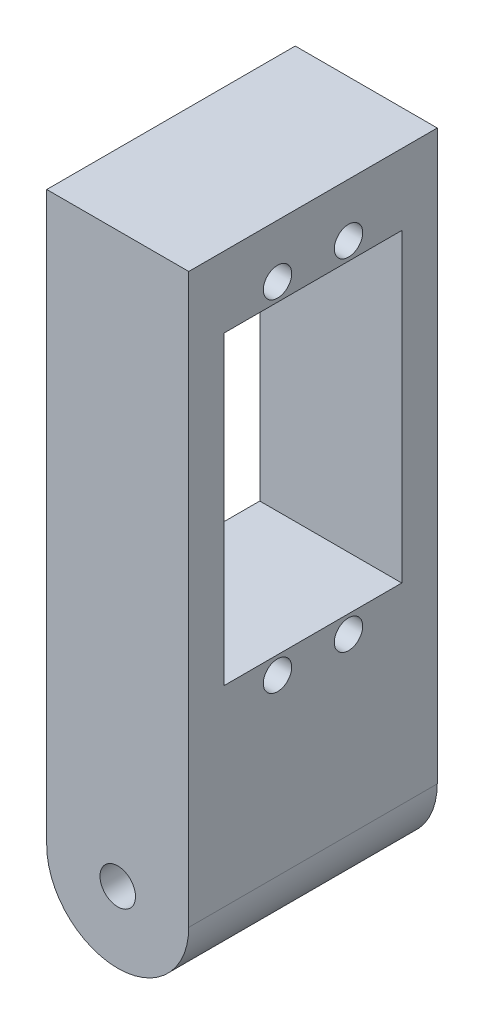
ISO-10303-21;
HEADER;
FILE_DESCRIPTION(('STEP AP214'),'2;1');
FILE_NAME('part.step','',(''),(''),'','','');
FILE_SCHEMA(('AUTOMOTIVE_DESIGN { 1 0 10303 214 1 1 1 1 }'));
ENDSEC;
DATA;
#1=APPLICATION_CONTEXT('core data for automotive mechanical design processes');
#2=APPLICATION_PROTOCOL_DEFINITION('international standard','automotive_design',2000,#1);
#3=PRODUCT_CONTEXT('',#1,'mechanical');
#4=PRODUCT('Part','Part','',(#3));
#5=PRODUCT_RELATED_PRODUCT_CATEGORY('part','',(#4));
#6=PRODUCT_DEFINITION_FORMATION('','',#4);
#7=PRODUCT_DEFINITION_CONTEXT('part definition',#1,'design');
#8=PRODUCT_DEFINITION('design','',#6,#7);
#9=PRODUCT_DEFINITION_SHAPE('','',#8);
#10=(LENGTH_UNIT() NAMED_UNIT(*) SI_UNIT(.MILLI.,.METRE.));
#11=(NAMED_UNIT(*) PLANE_ANGLE_UNIT() SI_UNIT($,.RADIAN.));
#12=(NAMED_UNIT(*) SI_UNIT($,.STERADIAN.) SOLID_ANGLE_UNIT());
#13=UNCERTAINTY_MEASURE_WITH_UNIT(LENGTH_MEASURE(1.E-05),#10,'distance_accuracy_value','');
#14=(GEOMETRIC_REPRESENTATION_CONTEXT(3) GLOBAL_UNCERTAINTY_ASSIGNED_CONTEXT((#13)) GLOBAL_UNIT_ASSIGNED_CONTEXT((#10,
#11,#12)) REPRESENTATION_CONTEXT('',''));
#15=CARTESIAN_POINT('',(0.,0.,0.));
#16=DIRECTION('',(0.,0.,1.));
#17=DIRECTION('',(1.,0.,0.));
#18=AXIS2_PLACEMENT_3D('',#15,#16,#17);
#19=CARTESIAN_POINT('',(10.,-80.,35.));
#20=DIRECTION('',(0.,0.,1.));
#21=DIRECTION('',(1.,0.,0.));
#22=AXIS2_PLACEMENT_3D('',#19,#20,#21);
#23=PLANE('',#22);
#24=DIRECTION('',(0.,-1.,0.));
#25=VECTOR('',#24,1.);
#26=CARTESIAN_POINT('',(0.,-80.,35.));
#27=LINE('',#26,#25);
#28=CARTESIAN_POINT('',(0.,0.,35.));
#29=VERTEX_POINT('',#28);
#30=CARTESIAN_POINT('',(0.,-80.,35.));
#31=VERTEX_POINT('',#30);
#32=EDGE_CURVE('E143',#29,#31,#27,.T.);
#33=ORIENTED_EDGE('',*,*,#32,.T.);
#34=CARTESIAN_POINT('',(10.,-80.,35.));
#35=DIRECTION('',(0.,0.,1.));
#36=DIRECTION('',(1.,0.,0.));
#37=AXIS2_PLACEMENT_3D('',#34,#35,#36);
#38=CIRCLE('',#37,10.);
#39=CARTESIAN_POINT('',(20.,-80.,35.));
#40=VERTEX_POINT('',#39);
#41=EDGE_CURVE('E145',#31,#40,#38,.T.);
#42=ORIENTED_EDGE('',*,*,#41,.T.);
#43=DIRECTION('',(0.,1.,0.));
#44=VECTOR('',#43,1.);
#45=CARTESIAN_POINT('',(20.,0.,35.));
#46=LINE('',#45,#44);
#47=CARTESIAN_POINT('',(20.,0.,35.));
#48=VERTEX_POINT('',#47);
#49=EDGE_CURVE('E150',#40,#48,#46,.T.);
#50=ORIENTED_EDGE('',*,*,#49,.T.);
#51=DIRECTION('',(-1.,0.,0.));
#52=VECTOR('',#51,1.);
#53=CARTESIAN_POINT('',(0.,0.,35.));
#54=LINE('',#53,#52);
#55=EDGE_CURVE('E149',#48,#29,#54,.T.);
#56=ORIENTED_EDGE('',*,*,#55,.T.);
#57=EDGE_LOOP('',(#33,#42,#50,#56));
#58=FACE_BOUND('',#57,.T.);
#59=CARTESIAN_POINT('',(10.,-80.,35.));
#60=DIRECTION('',(0.,0.,1.));
#61=DIRECTION('',(1.,0.,0.));
#62=AXIS2_PLACEMENT_3D('',#59,#60,#61);
#63=CIRCLE('',#62,2.5);
#64=CARTESIAN_POINT('',(12.5,-80.,35.));
#65=VERTEX_POINT('',#64);
#66=EDGE_CURVE('E134',#65,#65,#63,.T.);
#67=ORIENTED_EDGE('',*,*,#66,.F.);
#68=EDGE_LOOP('',(#67));
#69=FACE_BOUND('',#68,.T.);
#70=ADVANCED_FACE('F39',(#58,#69),#23,.T.);
#71=CARTESIAN_POINT('',(10.,-80.,0.));
#72=DIRECTION('',(0.,0.,1.));
#73=DIRECTION('',(1.,0.,0.));
#74=AXIS2_PLACEMENT_3D('',#71,#72,#73);
#75=PLANE('',#74);
#76=DIRECTION('',(0.,-1.,0.));
#77=VECTOR('',#76,1.);
#78=CARTESIAN_POINT('',(0.,-80.,0.));
#79=LINE('',#78,#77);
#80=CARTESIAN_POINT('',(0.,0.,0.));
#81=VERTEX_POINT('',#80);
#82=CARTESIAN_POINT('',(0.,-80.,0.));
#83=VERTEX_POINT('',#82);
#84=EDGE_CURVE('E140',#81,#83,#79,.T.);
#85=ORIENTED_EDGE('',*,*,#84,.F.);
#86=DIRECTION('',(-1.,0.,0.));
#87=VECTOR('',#86,1.);
#88=CARTESIAN_POINT('',(0.,0.,0.));
#89=LINE('',#88,#87);
#90=CARTESIAN_POINT('',(20.,0.,0.));
#91=VERTEX_POINT('',#90);
#92=EDGE_CURVE('E144',#91,#81,#89,.T.);
#93=ORIENTED_EDGE('',*,*,#92,.F.);
#94=DIRECTION('',(0.,1.,0.));
#95=VECTOR('',#94,1.);
#96=CARTESIAN_POINT('',(20.,0.,0.));
#97=LINE('',#96,#95);
#98=CARTESIAN_POINT('',(20.,-80.,0.));
#99=VERTEX_POINT('',#98);
#100=EDGE_CURVE('E156',#99,#91,#97,.T.);
#101=ORIENTED_EDGE('',*,*,#100,.F.);
#102=CARTESIAN_POINT('',(10.,-80.,0.));
#103=DIRECTION('',(0.,0.,1.));
#104=DIRECTION('',(1.,0.,0.));
#105=AXIS2_PLACEMENT_3D('',#102,#103,#104);
#106=CIRCLE('',#105,10.);
#107=EDGE_CURVE('E152',#83,#99,#106,.T.);
#108=ORIENTED_EDGE('',*,*,#107,.F.);
#109=EDGE_LOOP('',(#85,#93,#101,#108));
#110=FACE_BOUND('',#109,.T.);
#111=CARTESIAN_POINT('',(10.,-80.,0.));
#112=DIRECTION('',(0.,0.,1.));
#113=DIRECTION('',(1.,0.,0.));
#114=AXIS2_PLACEMENT_3D('',#111,#112,#113);
#115=CIRCLE('',#114,2.5);
#116=CARTESIAN_POINT('',(12.5,-80.,0.));
#117=VERTEX_POINT('',#116);
#118=EDGE_CURVE('E136',#117,#117,#115,.T.);
#119=ORIENTED_EDGE('',*,*,#118,.T.);
#120=EDGE_LOOP('',(#119));
#121=FACE_BOUND('',#120,.T.);
#122=ADVANCED_FACE('F205',(#110,#121),#75,.F.);
#123=CARTESIAN_POINT('',(0.,-80.,35.));
#124=DIRECTION('',(1.,0.,0.));
#125=DIRECTION('',(0.,0.,-1.));
#126=AXIS2_PLACEMENT_3D('',#123,#124,#125);
#127=PLANE('',#126);
#128=CARTESIAN_POINT('',(0.,-55.5,12.5));
#129=DIRECTION('',(-1.,0.,0.));
#130=DIRECTION('',(0.,0.,1.));
#131=AXIS2_PLACEMENT_3D('',#128,#129,#130);
#132=CIRCLE('',#131,2.);
#133=CARTESIAN_POINT('',(0.,-55.5,14.5));
#134=VERTEX_POINT('',#133);
#135=EDGE_CURVE('E356',#134,#134,#132,.T.);
#136=ORIENTED_EDGE('',*,*,#135,.F.);
#137=EDGE_LOOP('',(#136));
#138=FACE_BOUND('',#137,.T.);
#139=CARTESIAN_POINT('',(0.,-55.5,22.5));
#140=DIRECTION('',(-1.,0.,0.));
#141=DIRECTION('',(0.,0.,1.));
#142=AXIS2_PLACEMENT_3D('',#139,#140,#141);
#143=CIRCLE('',#142,2.00000000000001);
#144=CARTESIAN_POINT('',(0.,-55.5,24.5));
#145=VERTEX_POINT('',#144);
#146=EDGE_CURVE('E357',#145,#145,#143,.T.);
#147=ORIENTED_EDGE('',*,*,#146,.F.);
#148=EDGE_LOOP('',(#147));
#149=FACE_BOUND('',#148,.T.);
#150=CARTESIAN_POINT('',(0.,-7.50000000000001,22.5));
#151=DIRECTION('',(-1.,0.,0.));
#152=DIRECTION('',(0.,0.,1.));
#153=AXIS2_PLACEMENT_3D('',#150,#151,#152);
#154=CIRCLE('',#153,2.);
#155=CARTESIAN_POINT('',(0.,-7.50000000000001,24.5));
#156=VERTEX_POINT('',#155);
#157=EDGE_CURVE('E350',#156,#156,#154,.T.);
#158=ORIENTED_EDGE('',*,*,#157,.F.);
#159=EDGE_LOOP('',(#158));
#160=FACE_BOUND('',#159,.T.);
#161=CARTESIAN_POINT('',(0.,-7.50000000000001,12.5));
#162=DIRECTION('',(-1.,0.,0.));
#163=DIRECTION('',(0.,0.,1.));
#164=AXIS2_PLACEMENT_3D('',#161,#162,#163);
#165=CIRCLE('',#164,2.);
#166=CARTESIAN_POINT('',(0.,-7.50000000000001,14.5));
#167=VERTEX_POINT('',#166);
#168=EDGE_CURVE('E354',#167,#167,#165,.T.);
#169=ORIENTED_EDGE('',*,*,#168,.F.);
#170=EDGE_LOOP('',(#169));
#171=FACE_BOUND('',#170,.T.);
#172=DIRECTION('',(0.,-1.,0.));
#173=VECTOR('',#172,1.);
#174=CARTESIAN_POINT('',(0.,-53.,5.));
#175=LINE('',#174,#173);
#176=CARTESIAN_POINT('',(0.,-9.99999999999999,5.));
#177=VERTEX_POINT('',#176);
#178=CARTESIAN_POINT('',(0.,-53.,5.));
#179=VERTEX_POINT('',#178);
#180=EDGE_CURVE('E116',#177,#179,#175,.T.);
#181=ORIENTED_EDGE('',*,*,#180,.F.);
#182=DIRECTION('',(0.,0.,-1.));
#183=VECTOR('',#182,1.);
#184=CARTESIAN_POINT('',(0.,-9.99999999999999,5.));
#185=LINE('',#184,#183);
#186=CARTESIAN_POINT('',(0.,-9.99999999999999,30.));
#187=VERTEX_POINT('',#186);
#188=EDGE_CURVE('E57',#187,#177,#185,.T.);
#189=ORIENTED_EDGE('',*,*,#188,.F.);
#190=DIRECTION('',(0.,1.,0.));
#191=VECTOR('',#190,1.);
#192=CARTESIAN_POINT('',(0.,-9.99999999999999,30.));
#193=LINE('',#192,#191);
#194=CARTESIAN_POINT('',(0.,-53.,30.));
#195=VERTEX_POINT('',#194);
#196=EDGE_CURVE('E124',#195,#187,#193,.T.);
#197=ORIENTED_EDGE('',*,*,#196,.F.);
#198=DIRECTION('',(0.,0.,1.));
#199=VECTOR('',#198,1.);
#200=CARTESIAN_POINT('',(0.,-53.,30.));
#201=LINE('',#200,#199);
#202=EDGE_CURVE('E108',#179,#195,#201,.T.);
#203=ORIENTED_EDGE('',*,*,#202,.F.);
#204=EDGE_LOOP('',(#181,#189,#197,#203));
#205=FACE_BOUND('',#204,.T.);
#206=ORIENTED_EDGE('',*,*,#84,.T.);
#207=DIRECTION('',(0.,0.,-1.));
#208=VECTOR('',#207,1.);
#209=CARTESIAN_POINT('',(0.,-80.,35.));
#210=LINE('',#209,#208);
#211=EDGE_CURVE('E170',#31,#83,#210,.T.);
#212=ORIENTED_EDGE('',*,*,#211,.F.);
#213=ORIENTED_EDGE('',*,*,#32,.F.);
#214=DIRECTION('',(0.,0.,-1.));
#215=VECTOR('',#214,1.);
#216=CARTESIAN_POINT('',(0.,0.,35.));
#217=LINE('',#216,#215);
#218=EDGE_CURVE('E151',#29,#81,#217,.T.);
#219=ORIENTED_EDGE('',*,*,#218,.T.);
#220=EDGE_LOOP('',(#206,#212,#213,#219));
#221=FACE_BOUND('',#220,.T.);
#222=ADVANCED_FACE('F41',(#138,#149,#160,#171,#205,#221),#127,.F.);
#223=CARTESIAN_POINT('',(10.,-80.,35.));
#224=DIRECTION('',(0.,0.,-1.));
#225=DIRECTION('',(-1.,0.,0.));
#226=AXIS2_PLACEMENT_3D('',#223,#224,#225);
#227=CYLINDRICAL_SURFACE('',#226,10.);
#228=ORIENTED_EDGE('',*,*,#107,.T.);
#229=DIRECTION('',(0.,0.,-1.));
#230=VECTOR('',#229,1.);
#231=CARTESIAN_POINT('',(20.,-80.,35.));
#232=LINE('',#231,#230);
#233=EDGE_CURVE('E163',#40,#99,#232,.T.);
#234=ORIENTED_EDGE('',*,*,#233,.F.);
#235=ORIENTED_EDGE('',*,*,#41,.F.);
#236=ORIENTED_EDGE('',*,*,#211,.T.);
#237=EDGE_LOOP('',(#228,#234,#235,#236));
#238=FACE_BOUND('',#237,.T.);
#239=ADVANCED_FACE('F219',(#238),#227,.T.);
#240=CARTESIAN_POINT('',(20.,0.,35.));
#241=DIRECTION('',(-1.,0.,0.));
#242=DIRECTION('',(0.,-1.,0.));
#243=AXIS2_PLACEMENT_3D('',#240,#241,#242);
#244=PLANE('',#243);
#245=CARTESIAN_POINT('',(20.,-55.5,12.5));
#246=DIRECTION('',(-1.,0.,0.));
#247=DIRECTION('',(0.,-1.,0.));
#248=AXIS2_PLACEMENT_3D('',#245,#246,#247);
#249=CIRCLE('',#248,2.);
#250=CARTESIAN_POINT('',(20.,-57.5,12.5));
#251=VERTEX_POINT('',#250);
#252=EDGE_CURVE('E43',#251,#251,#249,.T.);
#253=ORIENTED_EDGE('',*,*,#252,.T.);
#254=EDGE_LOOP('',(#253));
#255=FACE_BOUND('',#254,.T.);
#256=CARTESIAN_POINT('',(20.,-55.5,22.5));
#257=DIRECTION('',(-1.,0.,0.));
#258=DIRECTION('',(0.,-1.,0.));
#259=AXIS2_PLACEMENT_3D('',#256,#257,#258);
#260=CIRCLE('',#259,2.00000000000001);
#261=CARTESIAN_POINT('',(20.,-57.5,22.5));
#262=VERTEX_POINT('',#261);
#263=EDGE_CURVE('E179',#262,#262,#260,.T.);
#264=ORIENTED_EDGE('',*,*,#263,.T.);
#265=EDGE_LOOP('',(#264));
#266=FACE_BOUND('',#265,.T.);
#267=CARTESIAN_POINT('',(20.,-7.50000000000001,22.5));
#268=DIRECTION('',(-1.,0.,0.));
#269=DIRECTION('',(0.,-1.,0.));
#270=AXIS2_PLACEMENT_3D('',#267,#268,#269);
#271=CIRCLE('',#270,2.);
#272=CARTESIAN_POINT('',(20.,-9.50000000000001,22.5));
#273=VERTEX_POINT('',#272);
#274=EDGE_CURVE('E180',#273,#273,#271,.T.);
#275=ORIENTED_EDGE('',*,*,#274,.T.);
#276=EDGE_LOOP('',(#275));
#277=FACE_BOUND('',#276,.T.);
#278=CARTESIAN_POINT('',(20.,-7.50000000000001,12.5));
#279=DIRECTION('',(-1.,0.,0.));
#280=DIRECTION('',(0.,-1.,0.));
#281=AXIS2_PLACEMENT_3D('',#278,#279,#280);
#282=CIRCLE('',#281,2.);
#283=CARTESIAN_POINT('',(20.,-9.50000000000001,12.5));
#284=VERTEX_POINT('',#283);
#285=EDGE_CURVE('E133',#284,#284,#282,.T.);
#286=ORIENTED_EDGE('',*,*,#285,.T.);
#287=EDGE_LOOP('',(#286));
#288=FACE_BOUND('',#287,.T.);
#289=DIRECTION('',(0.,1.,0.));
#290=VECTOR('',#289,1.);
#291=CARTESIAN_POINT('',(20.,0.,30.));
#292=LINE('',#291,#290);
#293=CARTESIAN_POINT('',(20.,-53.,30.));
#294=VERTEX_POINT('',#293);
#295=CARTESIAN_POINT('',(20.,-9.99999999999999,30.));
#296=VERTEX_POINT('',#295);
#297=EDGE_CURVE('E48',#294,#296,#292,.T.);
#298=ORIENTED_EDGE('',*,*,#297,.T.);
#299=DIRECTION('',(0.,0.,-1.));
#300=VECTOR('',#299,1.);
#301=CARTESIAN_POINT('',(20.,-9.99999999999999,35.));
#302=LINE('',#301,#300);
#303=CARTESIAN_POINT('',(20.,-9.99999999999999,5.));
#304=VERTEX_POINT('',#303);
#305=EDGE_CURVE('E11',#296,#304,#302,.T.);
#306=ORIENTED_EDGE('',*,*,#305,.T.);
#307=DIRECTION('',(0.,-1.,0.));
#308=VECTOR('',#307,1.);
#309=CARTESIAN_POINT('',(20.,0.,5.));
#310=LINE('',#309,#308);
#311=CARTESIAN_POINT('',(20.,-53.,5.));
#312=VERTEX_POINT('',#311);
#313=EDGE_CURVE('E168',#304,#312,#310,.T.);
#314=ORIENTED_EDGE('',*,*,#313,.T.);
#315=DIRECTION('',(0.,0.,1.));
#316=VECTOR('',#315,1.);
#317=CARTESIAN_POINT('',(20.,-53.,35.));
#318=LINE('',#317,#316);
#319=EDGE_CURVE('E115',#312,#294,#318,.T.);
#320=ORIENTED_EDGE('',*,*,#319,.T.);
#321=EDGE_LOOP('',(#298,#306,#314,#320));
#322=FACE_BOUND('',#321,.T.);
#323=ORIENTED_EDGE('',*,*,#100,.T.);
#324=DIRECTION('',(0.,0.,-1.));
#325=VECTOR('',#324,1.);
#326=CARTESIAN_POINT('',(20.,0.,35.));
#327=LINE('',#326,#325);
#328=EDGE_CURVE('E161',#48,#91,#327,.T.);
#329=ORIENTED_EDGE('',*,*,#328,.F.);
#330=ORIENTED_EDGE('',*,*,#49,.F.);
#331=ORIENTED_EDGE('',*,*,#233,.T.);
#332=EDGE_LOOP('',(#323,#329,#330,#331));
#333=FACE_BOUND('',#332,.T.);
#334=ADVANCED_FACE('F188',(#255,#266,#277,#288,#322,#333),#244,.F.);
#335=CARTESIAN_POINT('',(0.,0.,35.));
#336=DIRECTION('',(0.,-1.,0.));
#337=DIRECTION('',(0.,0.,-1.));
#338=AXIS2_PLACEMENT_3D('',#335,#336,#337);
#339=PLANE('',#338);
#340=ORIENTED_EDGE('',*,*,#92,.T.);
#341=ORIENTED_EDGE('',*,*,#218,.F.);
#342=ORIENTED_EDGE('',*,*,#55,.F.);
#343=ORIENTED_EDGE('',*,*,#328,.T.);
#344=EDGE_LOOP('',(#340,#341,#342,#343));
#345=FACE_BOUND('',#344,.T.);
#346=ADVANCED_FACE('F214',(#345),#339,.F.);
#347=CARTESIAN_POINT('',(10.,-80.,35.));
#348=DIRECTION('',(0.,0.,-1.));
#349=DIRECTION('',(-1.,0.,0.));
#350=AXIS2_PLACEMENT_3D('',#347,#348,#349);
#351=CYLINDRICAL_SURFACE('',#350,2.5);
#352=ORIENTED_EDGE('',*,*,#66,.T.);
#353=EDGE_LOOP('',(#352));
#354=FACE_BOUND('',#353,.T.);
#355=ORIENTED_EDGE('',*,*,#118,.F.);
#356=EDGE_LOOP('',(#355));
#357=FACE_BOUND('',#356,.T.);
#358=ADVANCED_FACE('F215',(#354,#357),#351,.F.);
#359=CARTESIAN_POINT('',(35.,-9.99999999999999,5.));
#360=DIRECTION('',(0.,1.,0.));
#361=DIRECTION('',(0.,0.,1.));
#362=AXIS2_PLACEMENT_3D('',#359,#360,#361);
#363=PLANE('',#362);
#364=DIRECTION('',(-1.,0.,0.));
#365=VECTOR('',#364,1.);
#366=CARTESIAN_POINT('',(35.,-9.99999999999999,30.));
#367=LINE('',#366,#365);
#368=EDGE_CURVE('E129',#296,#187,#367,.T.);
#369=ORIENTED_EDGE('',*,*,#368,.T.);
#370=ORIENTED_EDGE('',*,*,#188,.T.);
#371=DIRECTION('',(-1.,0.,0.));
#372=VECTOR('',#371,1.);
#373=CARTESIAN_POINT('',(35.,-9.99999999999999,5.));
#374=LINE('',#373,#372);
#375=EDGE_CURVE('E113',#304,#177,#374,.T.);
#376=ORIENTED_EDGE('',*,*,#375,.F.);
#377=ORIENTED_EDGE('',*,*,#305,.F.);
#378=EDGE_LOOP('',(#369,#370,#376,#377));
#379=FACE_BOUND('',#378,.T.);
#380=ADVANCED_FACE('F245',(#379),#363,.F.);
#381=CARTESIAN_POINT('',(35.,-9.99999999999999,30.));
#382=DIRECTION('',(0.,0.,1.));
#383=DIRECTION('',(1.,0.,0.));
#384=AXIS2_PLACEMENT_3D('',#381,#382,#383);
#385=PLANE('',#384);
#386=DIRECTION('',(-1.,0.,0.));
#387=VECTOR('',#386,1.);
#388=CARTESIAN_POINT('',(35.,-53.,30.));
#389=LINE('',#388,#387);
#390=EDGE_CURVE('E111',#294,#195,#389,.T.);
#391=ORIENTED_EDGE('',*,*,#390,.T.);
#392=ORIENTED_EDGE('',*,*,#196,.T.);
#393=ORIENTED_EDGE('',*,*,#368,.F.);
#394=ORIENTED_EDGE('',*,*,#297,.F.);
#395=EDGE_LOOP('',(#391,#392,#393,#394));
#396=FACE_BOUND('',#395,.T.);
#397=ADVANCED_FACE('F250',(#396),#385,.F.);
#398=CARTESIAN_POINT('',(35.,-53.,30.));
#399=DIRECTION('',(0.,-1.,0.));
#400=DIRECTION('',(0.,0.,-1.));
#401=AXIS2_PLACEMENT_3D('',#398,#399,#400);
#402=PLANE('',#401);
#403=DIRECTION('',(-1.,0.,0.));
#404=VECTOR('',#403,1.);
#405=CARTESIAN_POINT('',(35.,-53.,5.));
#406=LINE('',#405,#404);
#407=EDGE_CURVE('E64',#312,#179,#406,.T.);
#408=ORIENTED_EDGE('',*,*,#407,.T.);
#409=ORIENTED_EDGE('',*,*,#202,.T.);
#410=ORIENTED_EDGE('',*,*,#390,.F.);
#411=ORIENTED_EDGE('',*,*,#319,.F.);
#412=EDGE_LOOP('',(#408,#409,#410,#411));
#413=FACE_BOUND('',#412,.T.);
#414=ADVANCED_FACE('F106',(#413),#402,.F.);
#415=CARTESIAN_POINT('',(35.,-53.,5.));
#416=DIRECTION('',(0.,0.,-1.));
#417=DIRECTION('',(-1.,0.,0.));
#418=AXIS2_PLACEMENT_3D('',#415,#416,#417);
#419=PLANE('',#418);
#420=ORIENTED_EDGE('',*,*,#375,.T.);
#421=ORIENTED_EDGE('',*,*,#180,.T.);
#422=ORIENTED_EDGE('',*,*,#407,.F.);
#423=ORIENTED_EDGE('',*,*,#313,.F.);
#424=EDGE_LOOP('',(#420,#421,#422,#423));
#425=FACE_BOUND('',#424,.T.);
#426=ADVANCED_FACE('F119',(#425),#419,.F.);
#427=CARTESIAN_POINT('',(35.,-7.50000000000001,12.5));
#428=DIRECTION('',(-1.,0.,0.));
#429=DIRECTION('',(0.,0.,1.));
#430=AXIS2_PLACEMENT_3D('',#427,#428,#429);
#431=CYLINDRICAL_SURFACE('',#430,2.);
#432=ORIENTED_EDGE('',*,*,#168,.T.);
#433=EDGE_LOOP('',(#432));
#434=FACE_BOUND('',#433,.T.);
#435=ORIENTED_EDGE('',*,*,#285,.F.);
#436=EDGE_LOOP('',(#435));
#437=FACE_BOUND('',#436,.T.);
#438=ADVANCED_FACE('F258',(#434,#437),#431,.F.);
#439=CARTESIAN_POINT('',(35.,-7.50000000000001,22.5));
#440=DIRECTION('',(-1.,0.,0.));
#441=DIRECTION('',(0.,0.,1.));
#442=AXIS2_PLACEMENT_3D('',#439,#440,#441);
#443=CYLINDRICAL_SURFACE('',#442,2.);
#444=ORIENTED_EDGE('',*,*,#157,.T.);
#445=EDGE_LOOP('',(#444));
#446=FACE_BOUND('',#445,.T.);
#447=ORIENTED_EDGE('',*,*,#274,.F.);
#448=EDGE_LOOP('',(#447));
#449=FACE_BOUND('',#448,.T.);
#450=ADVANCED_FACE('F198',(#446,#449),#443,.F.);
#451=CARTESIAN_POINT('',(35.,-55.5,22.5));
#452=DIRECTION('',(-1.,0.,0.));
#453=DIRECTION('',(0.,0.,1.));
#454=AXIS2_PLACEMENT_3D('',#451,#452,#453);
#455=CYLINDRICAL_SURFACE('',#454,2.00000000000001);
#456=ORIENTED_EDGE('',*,*,#146,.T.);
#457=EDGE_LOOP('',(#456));
#458=FACE_BOUND('',#457,.T.);
#459=ORIENTED_EDGE('',*,*,#263,.F.);
#460=EDGE_LOOP('',(#459));
#461=FACE_BOUND('',#460,.T.);
#462=ADVANCED_FACE('F187',(#458,#461),#455,.F.);
#463=CARTESIAN_POINT('',(35.,-55.5,12.5));
#464=DIRECTION('',(-1.,0.,0.));
#465=DIRECTION('',(0.,0.,1.));
#466=AXIS2_PLACEMENT_3D('',#463,#464,#465);
#467=CYLINDRICAL_SURFACE('',#466,2.);
#468=ORIENTED_EDGE('',*,*,#135,.T.);
#469=EDGE_LOOP('',(#468));
#470=FACE_BOUND('',#469,.T.);
#471=ORIENTED_EDGE('',*,*,#252,.F.);
#472=EDGE_LOOP('',(#471));
#473=FACE_BOUND('',#472,.T.);
#474=ADVANCED_FACE('F186',(#470,#473),#467,.F.);
#475=CLOSED_SHELL('',(#70,#122,#222,#239,#334,#346,#358,#380,#397,#414,#426,#438,#450,#462,#474));
#476=MANIFOLD_SOLID_BREP('B2',#475);
#477=ADVANCED_BREP_SHAPE_REPRESENTATION('',(#18,#476),#14);
#478=SHAPE_DEFINITION_REPRESENTATION(#9,#477);
ENDSEC;
END-ISO-10303-21;
